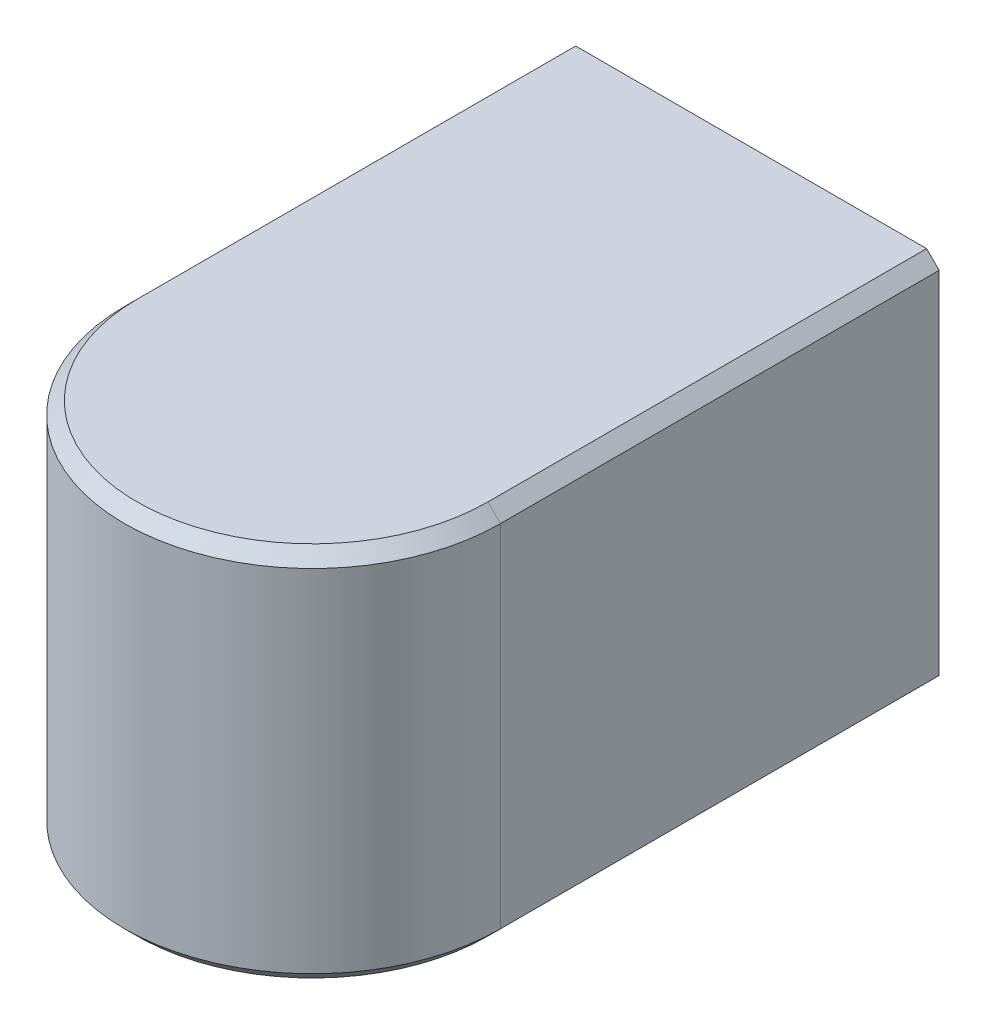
from build123d import *

# Parameters (mm, degrees)
ESQUISSE1_W      = 6
ESQUISSE1_H      = 6
EXTRUSION1_DEPTH = 3.5
EXTRUSION2_DEPTH = 6
CHANFREIN2_SIZE  = 0.2
CHANFREIN3_SIZE  = 0.2


with BuildPart() as part:
    # Esquisse1 → Extrusion1 (new, symmetric)
    with BuildSketch(Plane.XY):
        Rectangle(ESQUISSE1_W, ESQUISSE1_H)
    extrude(amount=EXTRUSION1_DEPTH, both=True)

    # Esquisse2 → Extrusion2 (add)
    with BuildSketch(Plane(origin=(0, 3, 0), x_dir=(-1, 0, 0), z_dir=(0, 1, 0))):
        with BuildLine():
            Line((-3, 3.5), (3, 3.5))
            ThreePointArc((3, 3.5), (0, 6.5), (-3, 3.5))
        make_face()
    extrude(amount=-EXTRUSION2_DEPTH)

    # Chanfrein2
    chanfrein2_edges = [part.edges().sort_by_distance(p)[0] for p in [
        (0, 3, 6.5),
        (-3, 3, 0),
        (3, 3, 0),
    ]]
    chamfer(chanfrein2_edges, length=CHANFREIN2_SIZE)

    # Chanfrein3
    chanfrein3_edges = [part.edges().sort_by_distance(p)[0] for p in [
        (0, -3, 6.5),
        (3, -3, 0),
        (-3, -3, 0),
    ]]
    chamfer(chanfrein3_edges, length=CHANFREIN3_SIZE)


solid = part.part
